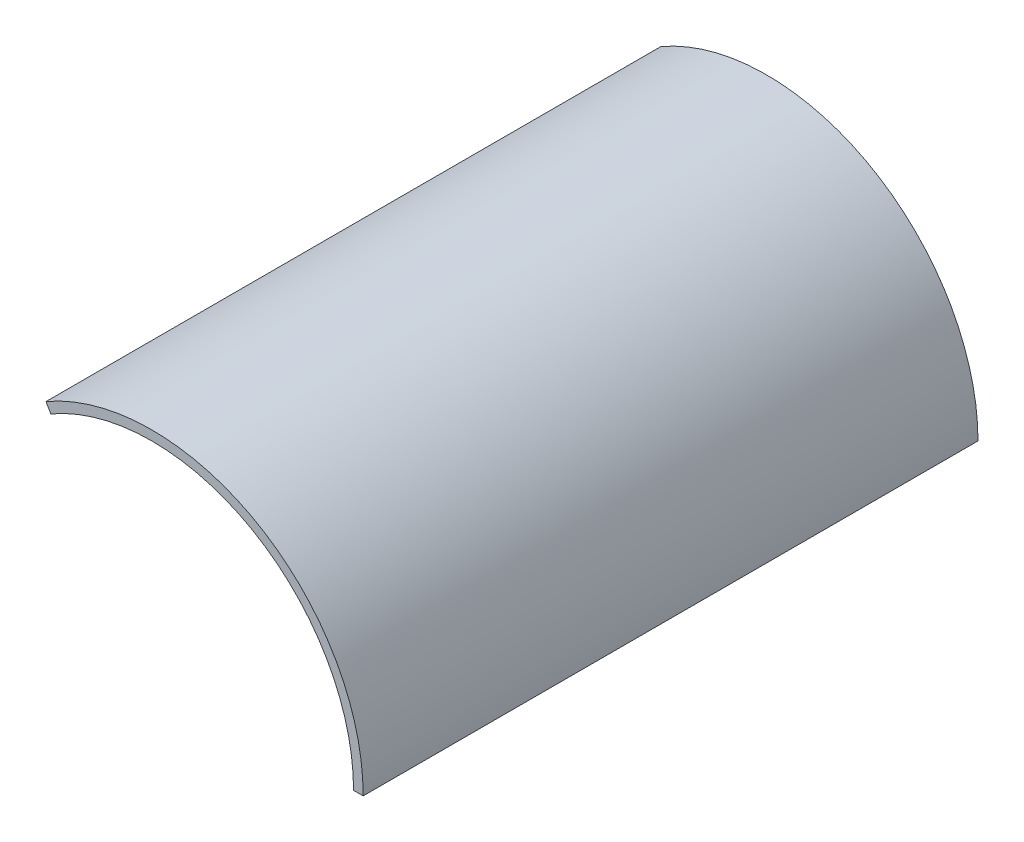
ISO-10303-21;
HEADER;
FILE_DESCRIPTION(('STEP AP214'),'2;1');
FILE_NAME('part.step','',(''),(''),'','','');
FILE_SCHEMA(('AUTOMOTIVE_DESIGN { 1 0 10303 214 1 1 1 1 }'));
ENDSEC;
DATA;
#1=APPLICATION_CONTEXT('core data for automotive mechanical design processes');
#2=APPLICATION_PROTOCOL_DEFINITION('international standard','automotive_design',2000,#1);
#3=PRODUCT_CONTEXT('',#1,'mechanical');
#4=PRODUCT('Part','Part','',(#3));
#5=PRODUCT_RELATED_PRODUCT_CATEGORY('part','',(#4));
#6=PRODUCT_DEFINITION_FORMATION('','',#4);
#7=PRODUCT_DEFINITION_CONTEXT('part definition',#1,'design');
#8=PRODUCT_DEFINITION('design','',#6,#7);
#9=PRODUCT_DEFINITION_SHAPE('','',#8);
#10=(LENGTH_UNIT() NAMED_UNIT(*) SI_UNIT(.MILLI.,.METRE.));
#11=(NAMED_UNIT(*) PLANE_ANGLE_UNIT() SI_UNIT($,.RADIAN.));
#12=(NAMED_UNIT(*) SI_UNIT($,.STERADIAN.) SOLID_ANGLE_UNIT());
#13=UNCERTAINTY_MEASURE_WITH_UNIT(LENGTH_MEASURE(1.E-05),#10,'distance_accuracy_value','');
#14=(GEOMETRIC_REPRESENTATION_CONTEXT(3) GLOBAL_UNCERTAINTY_ASSIGNED_CONTEXT((#13)) GLOBAL_UNIT_ASSIGNED_CONTEXT((#10,
#11,#12)) REPRESENTATION_CONTEXT('',''));
#15=CARTESIAN_POINT('',(0.,0.,0.));
#16=DIRECTION('',(0.,0.,1.));
#17=DIRECTION('',(1.,0.,0.));
#18=AXIS2_PLACEMENT_3D('',#15,#16,#17);
#19=CARTESIAN_POINT('',(0.,0.,32.));
#20=DIRECTION('',(0.,1.,0.));
#21=DIRECTION('',(0.,0.,1.));
#22=AXIS2_PLACEMENT_3D('',#19,#20,#21);
#23=PLANE('',#22);
#24=DIRECTION('',(1.,0.,0.));
#25=VECTOR('',#24,1.);
#26=CARTESIAN_POINT('',(0.,0.,0.));
#27=LINE('',#26,#25);
#28=CARTESIAN_POINT('',(10.5,0.,0.));
#29=VERTEX_POINT('',#28);
#30=CARTESIAN_POINT('',(11.,0.,0.));
#31=VERTEX_POINT('',#30);
#32=EDGE_CURVE('E124',#29,#31,#27,.T.);
#33=ORIENTED_EDGE('',*,*,#32,.T.);
#34=DIRECTION('',(0.,0.,-1.));
#35=VECTOR('',#34,1.);
#36=CARTESIAN_POINT('',(11.,0.,32.));
#37=LINE('',#36,#35);
#38=CARTESIAN_POINT('',(11.,0.,32.));
#39=VERTEX_POINT('',#38);
#40=EDGE_CURVE('E11',#39,#31,#37,.T.);
#41=ORIENTED_EDGE('',*,*,#40,.F.);
#42=DIRECTION('',(1.,0.,0.));
#43=VECTOR('',#42,1.);
#44=CARTESIAN_POINT('',(0.,0.,32.));
#45=LINE('',#44,#43);
#46=CARTESIAN_POINT('',(10.5,0.,32.));
#47=VERTEX_POINT('',#46);
#48=EDGE_CURVE('E105',#47,#39,#45,.T.);
#49=ORIENTED_EDGE('',*,*,#48,.F.);
#50=DIRECTION('',(0.,0.,-1.));
#51=VECTOR('',#50,1.);
#52=CARTESIAN_POINT('',(10.5,0.,32.));
#53=LINE('',#52,#51);
#54=EDGE_CURVE('E62',#47,#29,#53,.T.);
#55=ORIENTED_EDGE('',*,*,#54,.T.);
#56=EDGE_LOOP('',(#33,#41,#49,#55));
#57=FACE_BOUND('',#56,.T.);
#58=ADVANCED_FACE('F41',(#57),#23,.F.);
#59=CARTESIAN_POINT('',(0.,0.,32.));
#60=DIRECTION('',(0.,0.,-1.));
#61=DIRECTION('',(-1.,0.,0.));
#62=AXIS2_PLACEMENT_3D('',#59,#60,#61);
#63=CYLINDRICAL_SURFACE('',#62,11.);
#64=CARTESIAN_POINT('',(0.,0.,0.));
#65=DIRECTION('',(0.,0.,1.));
#66=DIRECTION('',(1.,0.,0.));
#67=AXIS2_PLACEMENT_3D('',#64,#65,#66);
#68=CIRCLE('',#67,11.);
#69=CARTESIAN_POINT('',(-5.5080286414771,9.52163959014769,0.));
#70=VERTEX_POINT('',#69);
#71=EDGE_CURVE('E111',#31,#70,#68,.T.);
#72=ORIENTED_EDGE('',*,*,#71,.T.);
#73=DIRECTION('',(0.,0.,-1.));
#74=VECTOR('',#73,1.);
#75=CARTESIAN_POINT('',(-5.5080286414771,9.52163959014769,32.));
#76=LINE('',#75,#74);
#77=CARTESIAN_POINT('',(-5.5080286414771,9.52163959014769,32.));
#78=VERTEX_POINT('',#77);
#79=EDGE_CURVE('E50',#78,#70,#76,.T.);
#80=ORIENTED_EDGE('',*,*,#79,.F.);
#81=CARTESIAN_POINT('',(0.,0.,32.));
#82=DIRECTION('',(0.,0.,1.));
#83=DIRECTION('',(1.,0.,0.));
#84=AXIS2_PLACEMENT_3D('',#81,#82,#83);
#85=CIRCLE('',#84,11.);
#86=EDGE_CURVE('E96',#39,#78,#85,.T.);
#87=ORIENTED_EDGE('',*,*,#86,.F.);
#88=ORIENTED_EDGE('',*,*,#40,.T.);
#89=EDGE_LOOP('',(#72,#80,#87,#88));
#90=FACE_BOUND('',#89,.T.);
#91=ADVANCED_FACE('F110',(#90),#63,.T.);
#92=CARTESIAN_POINT('',(0.,0.,32.));
#93=DIRECTION('',(-0.865603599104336,-0.500729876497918,0.));
#94=DIRECTION('',(0.500729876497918,-0.865603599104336,0.));
#95=AXIS2_PLACEMENT_3D('',#92,#93,#94);
#96=PLANE('',#95);
#97=DIRECTION('',(-0.500729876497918,0.865603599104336,0.));
#98=VECTOR('',#97,1.);
#99=CARTESIAN_POINT('',(0.,0.,0.));
#100=LINE('',#99,#98);
#101=CARTESIAN_POINT('',(-5.25766370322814,9.08883779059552,0.));
#102=VERTEX_POINT('',#101);
#103=EDGE_CURVE('E128',#102,#70,#100,.T.);
#104=ORIENTED_EDGE('',*,*,#103,.F.);
#105=DIRECTION('',(0.,0.,-1.));
#106=VECTOR('',#105,1.);
#107=CARTESIAN_POINT('',(-5.25766370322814,9.08883779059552,32.));
#108=LINE('',#107,#106);
#109=CARTESIAN_POINT('',(-5.25766370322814,9.08883779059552,32.));
#110=VERTEX_POINT('',#109);
#111=EDGE_CURVE('E81',#110,#102,#108,.T.);
#112=ORIENTED_EDGE('',*,*,#111,.F.);
#113=DIRECTION('',(-0.500729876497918,0.865603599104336,0.));
#114=VECTOR('',#113,1.);
#115=CARTESIAN_POINT('',(0.,0.,32.));
#116=LINE('',#115,#114);
#117=EDGE_CURVE('E104',#110,#78,#116,.T.);
#118=ORIENTED_EDGE('',*,*,#117,.T.);
#119=ORIENTED_EDGE('',*,*,#79,.T.);
#120=EDGE_LOOP('',(#104,#112,#118,#119));
#121=FACE_BOUND('',#120,.T.);
#122=ADVANCED_FACE('F115',(#121),#96,.T.);
#123=CARTESIAN_POINT('',(0.,0.,32.));
#124=DIRECTION('',(0.,0.,-1.));
#125=DIRECTION('',(-1.,0.,0.));
#126=AXIS2_PLACEMENT_3D('',#123,#124,#125);
#127=CYLINDRICAL_SURFACE('',#126,10.5);
#128=CARTESIAN_POINT('',(0.,0.,0.));
#129=DIRECTION('',(0.,0.,1.));
#130=DIRECTION('',(1.,0.,0.));
#131=AXIS2_PLACEMENT_3D('',#128,#129,#130);
#132=CIRCLE('',#131,10.5);
#133=EDGE_CURVE('E131',#29,#102,#132,.T.);
#134=ORIENTED_EDGE('',*,*,#133,.F.);
#135=ORIENTED_EDGE('',*,*,#54,.F.);
#136=CARTESIAN_POINT('',(0.,0.,32.));
#137=DIRECTION('',(0.,0.,1.));
#138=DIRECTION('',(1.,0.,0.));
#139=AXIS2_PLACEMENT_3D('',#136,#137,#138);
#140=CIRCLE('',#139,10.5);
#141=EDGE_CURVE('E117',#47,#110,#140,.T.);
#142=ORIENTED_EDGE('',*,*,#141,.T.);
#143=ORIENTED_EDGE('',*,*,#111,.T.);
#144=EDGE_LOOP('',(#134,#135,#142,#143));
#145=FACE_BOUND('',#144,.T.);
#146=ADVANCED_FACE('F158',(#145),#127,.F.);
#147=CARTESIAN_POINT('',(0.,0.,32.));
#148=DIRECTION('',(0.,0.,1.));
#149=DIRECTION('',(1.,0.,0.));
#150=AXIS2_PLACEMENT_3D('',#147,#148,#149);
#151=PLANE('',#150);
#152=ORIENTED_EDGE('',*,*,#48,.T.);
#153=ORIENTED_EDGE('',*,*,#86,.T.);
#154=ORIENTED_EDGE('',*,*,#117,.F.);
#155=ORIENTED_EDGE('',*,*,#141,.F.);
#156=EDGE_LOOP('',(#152,#153,#154,#155));
#157=FACE_BOUND('',#156,.T.);
#158=ADVANCED_FACE('F101',(#157),#151,.T.);
#159=CARTESIAN_POINT('',(0.,0.,0.));
#160=DIRECTION('',(0.,0.,1.));
#161=DIRECTION('',(1.,0.,0.));
#162=AXIS2_PLACEMENT_3D('',#159,#160,#161);
#163=PLANE('',#162);
#164=ORIENTED_EDGE('',*,*,#32,.F.);
#165=ORIENTED_EDGE('',*,*,#133,.T.);
#166=ORIENTED_EDGE('',*,*,#103,.T.);
#167=ORIENTED_EDGE('',*,*,#71,.F.);
#168=EDGE_LOOP('',(#164,#165,#166,#167));
#169=FACE_BOUND('',#168,.T.);
#170=ADVANCED_FACE('F144',(#169),#163,.F.);
#171=CLOSED_SHELL('',(#58,#91,#122,#146,#158,#170));
#172=MANIFOLD_SOLID_BREP('B2',#171);
#173=ADVANCED_BREP_SHAPE_REPRESENTATION('',(#18,#172),#14);
#174=SHAPE_DEFINITION_REPRESENTATION(#9,#173);
ENDSEC;
END-ISO-10303-21;
